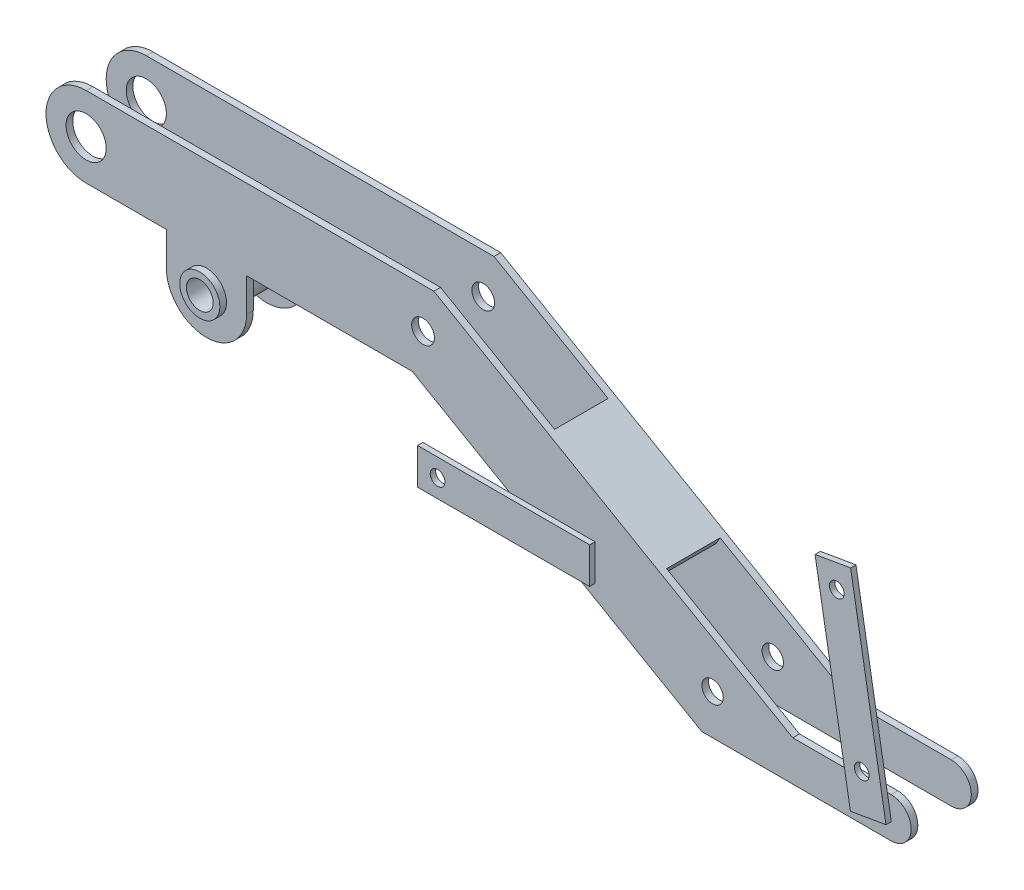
from build123d import *

# Parameters (mm, degrees)
ESQUISSE1_R           = 15
ESQUISSE1_R_2         = 8
ESQUISSE1_R_3         = 8.5
EXTRUSION1_DEPTH      = 5
EXTRUSION2_DEPTH      = 5
EXTRUSION2_DEPTH_BACK = 35
ESQUISSE2_R           = 15
ESQUISSE2_R_2         = 10
ESQUISSE3_W           = 65
ESQUISSE3_H           = 5
EXTRUSION3_DEPTH      = 30
EXTRUSION4_DEPTH      = 30
ESQUISSE5_R           = 5.5
ESQUISSE5_R_2         = 5.499999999
ESQUISSE5_W           = 128.72746263
ESQUISSE5_H           = 27
EXTRUSION5_DEPTH      = 4


with BuildPart() as part:
    # Esquisse1 → Extrusion1 (new body)
    with BuildSketch(Plane.XY):
        with BuildLine():
            Line((0, 30), (260, 30))
            Line((260, 30), (528.467875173, -125))
            Line((528.467875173, -125), (601.961524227, -125))
            ThreePointArc((601.961524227, -125), (616.961524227, -140), (601.961524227, -155))
            Line((601.961524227, -155), (460.4293994, -155))
            Line((460.4293994, -155), (243.923048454, -30))
            Line((243.923048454, -30), (120, -30))
            Line((120, -30), (120, -55))
            ThreePointArc((120, -55), (90, -85), (60, -55))
            Line((60, -55), (60, -30))
            Line((60, -30), (0, -30))
            ThreePointArc((0, -30), (-30, 0), (0, 30))
        make_face()
        Circle(ESQUISSE1_R, mode=Mode.SUBTRACT)
        with Locations((90, -55)):
            Circle(ESQUISSE1_R, mode=Mode.SUBTRACT)
        with Locations((468.467875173, -125)):
            Circle(ESQUISSE1_R_2, mode=Mode.SUBTRACT)
        with Locations((251.961524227, 0)):
            Circle(ESQUISSE1_R_3, mode=Mode.SUBTRACT)
    extrude(amount=EXTRUSION1_DEPTH)

    # Esquisse2 → Extrusion2 (add, two sides: drawn at the far end of the back side and taken through both)
    with BuildSketch(Plane.XY.offset(5).offset(-EXTRUSION2_DEPTH_BACK)):
        with Locations((90, -55)):
            Circle(ESQUISSE2_R)
        with Locations((90, -55)):
            Circle(ESQUISSE2_R_2, mode=Mode.SUBTRACT)
    extrude(amount=EXTRUSION2_DEPTH + EXTRUSION2_DEPTH_BACK)

    # Esquisse3 → Extrusion3 (add)
    with BuildSketch(Plane(origin=(0, 0, 0), x_dir=(-1, 0, 0), z_dir=(0, 0, -1))):
        with Locations((-89.5, -27.5)):
            Rectangle(ESQUISSE3_W, ESQUISSE3_H)
    extrude(amount=EXTRUSION3_DEPTH)

    # Esquisse4 → Extrusion4 (add)
    with BuildSketch(Plane(origin=(0, 0, 0), x_dir=(-1, 0, 0), z_dir=(0, 0, -1))):
        Polygon((-429.119905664, -67.64142306), (-345.362174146, -19.283874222), (-342.362174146, -24.480026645), (-426.119905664, -72.837575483), align=None)
    extrude(amount=EXTRUSION4_DEPTH)

    # Sym_trie5: part across plane


with BuildPart() as part_1:
    add(part.part)
    add(part.part.mirror(Plane.XY.offset(-20)))

    # Esquisse5 → Extrusion5 (add)
    # profile 1 of 2: a face of its own
    with BuildSketch(Plane.XY.offset(5)):
        Polygon((575.555925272, -147.041911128), (602.16175277, -142.445179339), (575.709687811, 10.65904984), (549.103860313, 6.062318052), align=None)
        with Locations((565.338116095, -8.60588797)):
            Circle(ESQUISSE5_R, mode=Mode.SUBTRACT)
        with Locations((584.065541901, -117)):
            Circle(ESQUISSE5_R_2, mode=Mode.SUBTRACT)
    # profile 2 of 2: a face of its own
    with BuildSketch(Plane.XY.offset(5)):
        with Locations((316.187969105, -85.48907529)):
            Rectangle(ESQUISSE5_W, ESQUISSE5_H)
        with Locations((266.82423779, -85.48907529)):
            Circle(ESQUISSE5_R, mode=Mode.SUBTRACT)
    extrude(amount=EXTRUSION5_DEPTH)


solid = part_1.part
